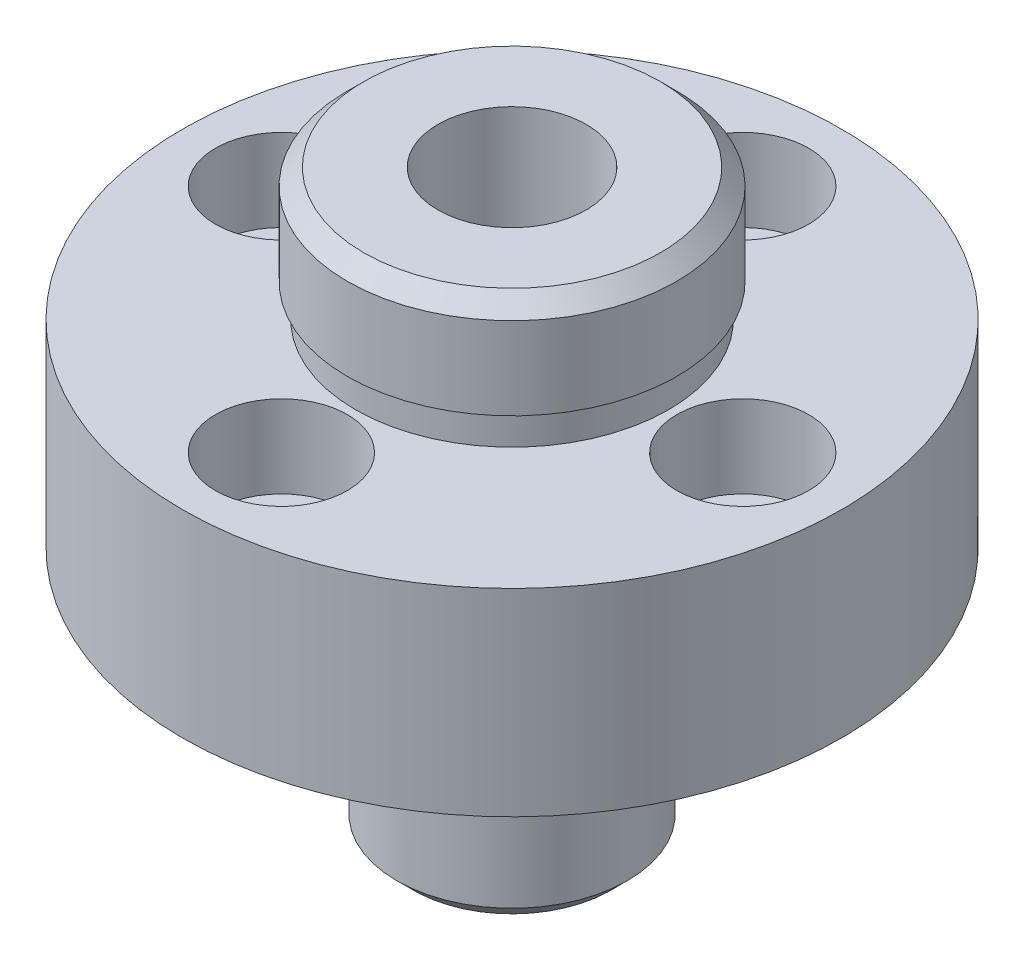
ISO-10303-21;
HEADER;
FILE_DESCRIPTION(('STEP AP214'),'2;1');
FILE_NAME('part.step','',(''),(''),'','','');
FILE_SCHEMA(('AUTOMOTIVE_DESIGN { 1 0 10303 214 1 1 1 1 }'));
ENDSEC;
DATA;
#1=APPLICATION_CONTEXT('core data for automotive mechanical design processes');
#2=APPLICATION_PROTOCOL_DEFINITION('international standard','automotive_design',2000,#1);
#3=PRODUCT_CONTEXT('',#1,'mechanical');
#4=PRODUCT('Part','Part','',(#3));
#5=PRODUCT_RELATED_PRODUCT_CATEGORY('part','',(#4));
#6=PRODUCT_DEFINITION_FORMATION('','',#4);
#7=PRODUCT_DEFINITION_CONTEXT('part definition',#1,'design');
#8=PRODUCT_DEFINITION('design','',#6,#7);
#9=PRODUCT_DEFINITION_SHAPE('','',#8);
#10=(LENGTH_UNIT() NAMED_UNIT(*) SI_UNIT(.MILLI.,.METRE.));
#11=(NAMED_UNIT(*) PLANE_ANGLE_UNIT() SI_UNIT($,.RADIAN.));
#12=(NAMED_UNIT(*) SI_UNIT($,.STERADIAN.) SOLID_ANGLE_UNIT());
#13=UNCERTAINTY_MEASURE_WITH_UNIT(LENGTH_MEASURE(1.E-05),#10,'distance_accuracy_value','');
#14=(GEOMETRIC_REPRESENTATION_CONTEXT(3) GLOBAL_UNCERTAINTY_ASSIGNED_CONTEXT((#13)) GLOBAL_UNIT_ASSIGNED_CONTEXT((#10,
#11,#12)) REPRESENTATION_CONTEXT('',''));
#15=CARTESIAN_POINT('',(0.,0.,0.));
#16=DIRECTION('',(0.,0.,1.));
#17=DIRECTION('',(1.,0.,0.));
#18=AXIS2_PLACEMENT_3D('',#15,#16,#17);
#19=CARTESIAN_POINT('',(0.,0.,0.));
#20=DIRECTION('',(0.,-1.,0.));
#21=DIRECTION('',(0.,0.,-1.));
#22=AXIS2_PLACEMENT_3D('',#19,#20,#21);
#23=PLANE('',#22);
#24=CARTESIAN_POINT('',(0.,0.,0.));
#25=DIRECTION('',(0.,1.,0.));
#26=DIRECTION('',(0.,0.,1.));
#27=AXIS2_PLACEMENT_3D('',#24,#25,#26);
#28=CIRCLE('',#27,4.49999999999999);
#29=CARTESIAN_POINT('',(0.,0.,4.49999999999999));
#30=VERTEX_POINT('',#29);
#31=EDGE_CURVE('E184',#30,#30,#28,.T.);
#32=ORIENTED_EDGE('',*,*,#31,.T.);
#33=EDGE_LOOP('',(#32));
#34=FACE_BOUND('',#33,.T.);
#35=CARTESIAN_POINT('',(0.,0.,0.));
#36=DIRECTION('',(0.,-1.,0.));
#37=DIRECTION('',(0.,0.,-1.));
#38=AXIS2_PLACEMENT_3D('',#35,#36,#37);
#39=CIRCLE('',#38,5.99999999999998);
#40=CARTESIAN_POINT('',(0.,0.,-5.99999999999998));
#41=VERTEX_POINT('',#40);
#42=EDGE_CURVE('E41',#41,#41,#39,.T.);
#43=ORIENTED_EDGE('',*,*,#42,.T.);
#44=EDGE_LOOP('',(#43));
#45=FACE_BOUND('',#44,.T.);
#46=ADVANCED_FACE('F28',(#34,#45),#23,.T.);
#47=CARTESIAN_POINT('',(0.,35.,0.));
#48=DIRECTION('',(0.,1.,0.));
#49=DIRECTION('',(0.,0.,1.));
#50=AXIS2_PLACEMENT_3D('',#47,#48,#49);
#51=CYLINDRICAL_SURFACE('',#50,7.);
#52=CARTESIAN_POINT('',(0.,1.,0.));
#53=DIRECTION('',(0.,-1.,0.));
#54=DIRECTION('',(0.,0.,-1.));
#55=AXIS2_PLACEMENT_3D('',#52,#53,#54);
#56=CIRCLE('',#55,7.);
#57=CARTESIAN_POINT('',(0.,1.,-7.));
#58=VERTEX_POINT('',#57);
#59=EDGE_CURVE('E107',#58,#58,#56,.F.);
#60=ORIENTED_EDGE('',*,*,#59,.T.);
#61=EDGE_LOOP('',(#60));
#62=FACE_BOUND('',#61,.T.);
#63=CARTESIAN_POINT('',(0.,13.,0.));
#64=DIRECTION('',(0.,1.,0.));
#65=DIRECTION('',(0.,0.,1.));
#66=AXIS2_PLACEMENT_3D('',#63,#64,#65);
#67=CIRCLE('',#66,7.);
#68=CARTESIAN_POINT('',(0.,13.,7.));
#69=VERTEX_POINT('',#68);
#70=EDGE_CURVE('E104',#69,#69,#67,.T.);
#71=ORIENTED_EDGE('',*,*,#70,.F.);
#72=EDGE_LOOP('',(#71));
#73=FACE_BOUND('',#72,.T.);
#74=ADVANCED_FACE('F119',(#62,#73),#51,.T.);
#75=CARTESIAN_POINT('',(-7.,13.,0.));
#76=DIRECTION('',(0.,1.,0.));
#77=DIRECTION('',(0.,0.,1.));
#78=AXIS2_PLACEMENT_3D('',#75,#76,#77);
#79=PLANE('',#78);
#80=ORIENTED_EDGE('',*,*,#70,.T.);
#81=EDGE_LOOP('',(#80));
#82=FACE_BOUND('',#81,.T.);
#83=CARTESIAN_POINT('',(0.,13.,0.));
#84=DIRECTION('',(0.,1.,0.));
#85=DIRECTION('',(0.,0.,1.));
#86=AXIS2_PLACEMENT_3D('',#83,#84,#85);
#87=CIRCLE('',#86,6.5);
#88=CARTESIAN_POINT('',(0.,13.,6.5));
#89=VERTEX_POINT('',#88);
#90=EDGE_CURVE('E101',#89,#89,#87,.T.);
#91=ORIENTED_EDGE('',*,*,#90,.F.);
#92=EDGE_LOOP('',(#91));
#93=FACE_BOUND('',#92,.T.);
#94=ADVANCED_FACE('F122',(#82,#93),#79,.T.);
#95=CARTESIAN_POINT('',(0.,35.,0.));
#96=DIRECTION('',(0.,1.,0.));
#97=DIRECTION('',(0.,0.,1.));
#98=AXIS2_PLACEMENT_3D('',#95,#96,#97);
#99=CYLINDRICAL_SURFACE('',#98,6.5);
#100=ORIENTED_EDGE('',*,*,#90,.T.);
#101=EDGE_LOOP('',(#100));
#102=FACE_BOUND('',#101,.T.);
#103=CARTESIAN_POINT('',(0.,15.,0.));
#104=DIRECTION('',(0.,1.,0.));
#105=DIRECTION('',(0.,0.,1.));
#106=AXIS2_PLACEMENT_3D('',#103,#104,#105);
#107=CIRCLE('',#106,6.5);
#108=CARTESIAN_POINT('',(0.,15.,6.5));
#109=VERTEX_POINT('',#108);
#110=EDGE_CURVE('E98',#109,#109,#107,.T.);
#111=ORIENTED_EDGE('',*,*,#110,.F.);
#112=EDGE_LOOP('',(#111));
#113=FACE_BOUND('',#112,.T.);
#114=ADVANCED_FACE('F128',(#102,#113),#99,.T.);
#115=CARTESIAN_POINT('',(-20.,15.,0.));
#116=DIRECTION('',(0.,-1.,0.));
#117=DIRECTION('',(0.,0.,-1.));
#118=AXIS2_PLACEMENT_3D('',#115,#116,#117);
#119=PLANE('',#118);
#120=CARTESIAN_POINT('',(-14.,15.,0.));
#121=DIRECTION('',(0.,-1.,0.));
#122=DIRECTION('',(0.,0.,-1.));
#123=AXIS2_PLACEMENT_3D('',#120,#121,#122);
#124=CIRCLE('',#123,2.25);
#125=CARTESIAN_POINT('',(-14.,15.,-2.25));
#126=VERTEX_POINT('',#125);
#127=EDGE_CURVE('E32',#126,#126,#124,.T.);
#128=ORIENTED_EDGE('',*,*,#127,.F.);
#129=EDGE_LOOP('',(#128));
#130=FACE_BOUND('',#129,.T.);
#131=CARTESIAN_POINT('',(0.,15.,-14.));
#132=DIRECTION('',(0.,-1.,0.));
#133=DIRECTION('',(0.,0.,-1.));
#134=AXIS2_PLACEMENT_3D('',#131,#132,#133);
#135=CIRCLE('',#134,2.25);
#136=CARTESIAN_POINT('',(0.,15.,-16.25));
#137=VERTEX_POINT('',#136);
#138=EDGE_CURVE('E54',#137,#137,#135,.T.);
#139=ORIENTED_EDGE('',*,*,#138,.F.);
#140=EDGE_LOOP('',(#139));
#141=FACE_BOUND('',#140,.T.);
#142=CARTESIAN_POINT('',(14.,15.,0.));
#143=DIRECTION('',(0.,-1.,0.));
#144=DIRECTION('',(0.,0.,-1.));
#145=AXIS2_PLACEMENT_3D('',#142,#143,#144);
#146=CIRCLE('',#145,2.25);
#147=CARTESIAN_POINT('',(14.,15.,-2.25));
#148=VERTEX_POINT('',#147);
#149=EDGE_CURVE('E50',#148,#148,#146,.T.);
#150=ORIENTED_EDGE('',*,*,#149,.F.);
#151=EDGE_LOOP('',(#150));
#152=FACE_BOUND('',#151,.T.);
#153=CARTESIAN_POINT('',(0.,15.,14.));
#154=DIRECTION('',(0.,-1.,0.));
#155=DIRECTION('',(0.,0.,-1.));
#156=AXIS2_PLACEMENT_3D('',#153,#154,#155);
#157=CIRCLE('',#156,2.25);
#158=CARTESIAN_POINT('',(0.,15.,11.75));
#159=VERTEX_POINT('',#158);
#160=EDGE_CURVE('E45',#159,#159,#157,.T.);
#161=ORIENTED_EDGE('',*,*,#160,.F.);
#162=EDGE_LOOP('',(#161));
#163=FACE_BOUND('',#162,.T.);
#164=ORIENTED_EDGE('',*,*,#110,.T.);
#165=EDGE_LOOP('',(#164));
#166=FACE_BOUND('',#165,.T.);
#167=CARTESIAN_POINT('',(0.,15.,0.));
#168=DIRECTION('',(0.,1.,0.));
#169=DIRECTION('',(0.,0.,1.));
#170=AXIS2_PLACEMENT_3D('',#167,#168,#169);
#171=CIRCLE('',#170,20.);
#172=CARTESIAN_POINT('',(0.,15.,20.));
#173=VERTEX_POINT('',#172);
#174=EDGE_CURVE('E95',#173,#173,#171,.T.);
#175=ORIENTED_EDGE('',*,*,#174,.F.);
#176=EDGE_LOOP('',(#175));
#177=FACE_BOUND('',#176,.T.);
#178=ADVANCED_FACE('F134',(#130,#141,#152,#163,#166,#177),#119,.T.);
#179=CARTESIAN_POINT('',(0.,35.,0.));
#180=DIRECTION('',(0.,1.,0.));
#181=DIRECTION('',(0.,0.,1.));
#182=AXIS2_PLACEMENT_3D('',#179,#180,#181);
#183=CYLINDRICAL_SURFACE('',#182,20.);
#184=ORIENTED_EDGE('',*,*,#174,.T.);
#185=EDGE_LOOP('',(#184));
#186=FACE_BOUND('',#185,.T.);
#187=CARTESIAN_POINT('',(0.,27.,0.));
#188=DIRECTION('',(0.,1.,0.));
#189=DIRECTION('',(0.,0.,1.));
#190=AXIS2_PLACEMENT_3D('',#187,#188,#189);
#191=CIRCLE('',#190,20.);
#192=CARTESIAN_POINT('',(0.,27.,20.));
#193=VERTEX_POINT('',#192);
#194=EDGE_CURVE('E92',#193,#193,#191,.T.);
#195=ORIENTED_EDGE('',*,*,#194,.F.);
#196=EDGE_LOOP('',(#195));
#197=FACE_BOUND('',#196,.T.);
#198=ADVANCED_FACE('F140',(#186,#197),#183,.T.);
#199=CARTESIAN_POINT('',(-20.,27.,0.));
#200=DIRECTION('',(0.,1.,0.));
#201=DIRECTION('',(0.,0.,1.));
#202=AXIS2_PLACEMENT_3D('',#199,#200,#201);
#203=PLANE('',#202);
#204=CARTESIAN_POINT('',(-14.,27.,0.));
#205=DIRECTION('',(0.,1.,0.));
#206=DIRECTION('',(0.,0.,1.));
#207=AXIS2_PLACEMENT_3D('',#204,#205,#206);
#208=CIRCLE('',#207,4.);
#209=CARTESIAN_POINT('',(-14.,27.,4.));
#210=VERTEX_POINT('',#209);
#211=EDGE_CURVE('E186',#210,#210,#208,.T.);
#212=ORIENTED_EDGE('',*,*,#211,.F.);
#213=EDGE_LOOP('',(#212));
#214=FACE_BOUND('',#213,.T.);
#215=CARTESIAN_POINT('',(0.,27.,-14.));
#216=DIRECTION('',(0.,1.,0.));
#217=DIRECTION('',(0.,0.,1.));
#218=AXIS2_PLACEMENT_3D('',#215,#216,#217);
#219=CIRCLE('',#218,4.);
#220=CARTESIAN_POINT('',(0.,27.,-10.));
#221=VERTEX_POINT('',#220);
#222=EDGE_CURVE('E69',#221,#221,#219,.T.);
#223=ORIENTED_EDGE('',*,*,#222,.F.);
#224=EDGE_LOOP('',(#223));
#225=FACE_BOUND('',#224,.T.);
#226=CARTESIAN_POINT('',(14.,27.,0.));
#227=DIRECTION('',(0.,1.,0.));
#228=DIRECTION('',(0.,0.,1.));
#229=AXIS2_PLACEMENT_3D('',#226,#227,#228);
#230=CIRCLE('',#229,4.);
#231=CARTESIAN_POINT('',(14.,27.,4.));
#232=VERTEX_POINT('',#231);
#233=EDGE_CURVE('E56',#232,#232,#230,.T.);
#234=ORIENTED_EDGE('',*,*,#233,.F.);
#235=EDGE_LOOP('',(#234));
#236=FACE_BOUND('',#235,.T.);
#237=CARTESIAN_POINT('',(0.,27.,14.));
#238=DIRECTION('',(0.,1.,0.));
#239=DIRECTION('',(0.,0.,1.));
#240=AXIS2_PLACEMENT_3D('',#237,#238,#239);
#241=CIRCLE('',#240,4.);
#242=CARTESIAN_POINT('',(0.,27.,18.));
#243=VERTEX_POINT('',#242);
#244=EDGE_CURVE('E52',#243,#243,#241,.T.);
#245=ORIENTED_EDGE('',*,*,#244,.F.);
#246=EDGE_LOOP('',(#245));
#247=FACE_BOUND('',#246,.T.);
#248=ORIENTED_EDGE('',*,*,#194,.T.);
#249=EDGE_LOOP('',(#248));
#250=FACE_BOUND('',#249,.T.);
#251=CARTESIAN_POINT('',(0.,27.,0.));
#252=DIRECTION('',(0.,1.,0.));
#253=DIRECTION('',(0.,0.,1.));
#254=AXIS2_PLACEMENT_3D('',#251,#252,#253);
#255=CIRCLE('',#254,9.5);
#256=CARTESIAN_POINT('',(0.,27.,9.5));
#257=VERTEX_POINT('',#256);
#258=EDGE_CURVE('E89',#257,#257,#255,.T.);
#259=ORIENTED_EDGE('',*,*,#258,.F.);
#260=EDGE_LOOP('',(#259));
#261=FACE_BOUND('',#260,.T.);
#262=ADVANCED_FACE('F147',(#214,#225,#236,#247,#250,#261),#203,.T.);
#263=CARTESIAN_POINT('',(0.,35.,0.));
#264=DIRECTION('',(0.,1.,0.));
#265=DIRECTION('',(0.,0.,1.));
#266=AXIS2_PLACEMENT_3D('',#263,#264,#265);
#267=CYLINDRICAL_SURFACE('',#266,9.5);
#268=ORIENTED_EDGE('',*,*,#258,.T.);
#269=EDGE_LOOP('',(#268));
#270=FACE_BOUND('',#269,.T.);
#271=CARTESIAN_POINT('',(0.,29.,0.));
#272=DIRECTION('',(0.,1.,0.));
#273=DIRECTION('',(0.,0.,1.));
#274=AXIS2_PLACEMENT_3D('',#271,#272,#273);
#275=CIRCLE('',#274,9.5);
#276=CARTESIAN_POINT('',(0.,29.,9.5));
#277=VERTEX_POINT('',#276);
#278=EDGE_CURVE('E86',#277,#277,#275,.T.);
#279=ORIENTED_EDGE('',*,*,#278,.F.);
#280=EDGE_LOOP('',(#279));
#281=FACE_BOUND('',#280,.T.);
#282=ADVANCED_FACE('F153',(#270,#281),#267,.T.);
#283=CARTESIAN_POINT('',(-9.5,29.,0.));
#284=DIRECTION('',(0.,-1.,0.));
#285=DIRECTION('',(0.,0.,-1.));
#286=AXIS2_PLACEMENT_3D('',#283,#284,#285);
#287=PLANE('',#286);
#288=ORIENTED_EDGE('',*,*,#278,.T.);
#289=EDGE_LOOP('',(#288));
#290=FACE_BOUND('',#289,.T.);
#291=CARTESIAN_POINT('',(0.,29.,0.));
#292=DIRECTION('',(0.,1.,0.));
#293=DIRECTION('',(0.,0.,1.));
#294=AXIS2_PLACEMENT_3D('',#291,#292,#293);
#295=CIRCLE('',#294,10.);
#296=CARTESIAN_POINT('',(0.,29.,10.));
#297=VERTEX_POINT('',#296);
#298=EDGE_CURVE('E48',#297,#297,#295,.T.);
#299=ORIENTED_EDGE('',*,*,#298,.F.);
#300=EDGE_LOOP('',(#299));
#301=FACE_BOUND('',#300,.T.);
#302=ADVANCED_FACE('F160',(#290,#301),#287,.T.);
#303=CARTESIAN_POINT('',(0.,35.,0.));
#304=DIRECTION('',(0.,1.,0.));
#305=DIRECTION('',(0.,0.,1.));
#306=AXIS2_PLACEMENT_3D('',#303,#304,#305);
#307=CYLINDRICAL_SURFACE('',#306,10.);
#308=CARTESIAN_POINT('',(0.,34.,0.));
#309=DIRECTION('',(0.,1.,0.));
#310=DIRECTION('',(0.,0.,1.));
#311=AXIS2_PLACEMENT_3D('',#308,#309,#310);
#312=CIRCLE('',#311,10.);
#313=CARTESIAN_POINT('',(0.,34.,10.));
#314=VERTEX_POINT('',#313);
#315=EDGE_CURVE('E10',#314,#314,#312,.F.);
#316=ORIENTED_EDGE('',*,*,#315,.T.);
#317=EDGE_LOOP('',(#316));
#318=FACE_BOUND('',#317,.T.);
#319=ORIENTED_EDGE('',*,*,#298,.T.);
#320=EDGE_LOOP('',(#319));
#321=FACE_BOUND('',#320,.T.);
#322=ADVANCED_FACE('F166',(#318,#321),#307,.T.);
#323=CARTESIAN_POINT('',(-10.,35.,0.));
#324=DIRECTION('',(0.,1.,0.));
#325=DIRECTION('',(0.,0.,1.));
#326=AXIS2_PLACEMENT_3D('',#323,#324,#325);
#327=PLANE('',#326);
#328=CARTESIAN_POINT('',(0.,35.,0.));
#329=DIRECTION('',(0.,1.,0.));
#330=DIRECTION('',(0.,0.,1.));
#331=AXIS2_PLACEMENT_3D('',#328,#329,#330);
#332=CIRCLE('',#331,4.49999999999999);
#333=CARTESIAN_POINT('',(0.,35.,4.49999999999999));
#334=VERTEX_POINT('',#333);
#335=EDGE_CURVE('E187',#334,#334,#332,.T.);
#336=ORIENTED_EDGE('',*,*,#335,.F.);
#337=EDGE_LOOP('',(#336));
#338=FACE_BOUND('',#337,.T.);
#339=CARTESIAN_POINT('',(0.,35.,0.));
#340=DIRECTION('',(0.,1.,0.));
#341=DIRECTION('',(0.,0.,1.));
#342=AXIS2_PLACEMENT_3D('',#339,#340,#341);
#343=CIRCLE('',#342,8.99999999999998);
#344=CARTESIAN_POINT('',(0.,35.,8.99999999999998));
#345=VERTEX_POINT('',#344);
#346=EDGE_CURVE('E36',#345,#345,#343,.T.);
#347=ORIENTED_EDGE('',*,*,#346,.T.);
#348=EDGE_LOOP('',(#347));
#349=FACE_BOUND('',#348,.T.);
#350=ADVANCED_FACE('F116',(#338,#349),#327,.T.);
#351=CARTESIAN_POINT('',(0.,1.,0.));
#352=DIRECTION('',(0.,1.,0.));
#353=DIRECTION('',(0.,0.,1.));
#354=AXIS2_PLACEMENT_3D('',#351,#352,#353);
#355=CONICAL_SURFACE('',#354,7.,0.785398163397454);
#356=ORIENTED_EDGE('',*,*,#42,.F.);
#357=EDGE_LOOP('',(#356));
#358=FACE_BOUND('',#357,.T.);
#359=ORIENTED_EDGE('',*,*,#59,.F.);
#360=EDGE_LOOP('',(#359));
#361=FACE_BOUND('',#360,.T.);
#362=ADVANCED_FACE('F113',(#358,#361),#355,.T.);
#363=CARTESIAN_POINT('',(0.,35.,0.));
#364=DIRECTION('',(0.,-1.,0.));
#365=DIRECTION('',(0.,0.,-1.));
#366=AXIS2_PLACEMENT_3D('',#363,#364,#365);
#367=CONICAL_SURFACE('',#366,8.99999999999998,0.785398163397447);
#368=ORIENTED_EDGE('',*,*,#315,.F.);
#369=EDGE_LOOP('',(#368));
#370=FACE_BOUND('',#369,.T.);
#371=ORIENTED_EDGE('',*,*,#346,.F.);
#372=EDGE_LOOP('',(#371));
#373=FACE_BOUND('',#372,.T.);
#374=ADVANCED_FACE('F30',(#370,#373),#367,.T.);
#375=CARTESIAN_POINT('',(0.,27.,14.));
#376=DIRECTION('',(0.,1.,0.));
#377=DIRECTION('',(0.,0.,1.));
#378=AXIS2_PLACEMENT_3D('',#375,#376,#377);
#379=CYLINDRICAL_SURFACE('',#378,2.25);
#380=ORIENTED_EDGE('',*,*,#160,.T.);
#381=EDGE_LOOP('',(#380));
#382=FACE_BOUND('',#381,.T.);
#383=CARTESIAN_POINT('',(0.,22.,14.));
#384=DIRECTION('',(0.,1.,0.));
#385=DIRECTION('',(0.,0.,1.));
#386=AXIS2_PLACEMENT_3D('',#383,#384,#385);
#387=CIRCLE('',#386,2.25);
#388=CARTESIAN_POINT('',(0.,22.,16.25));
#389=VERTEX_POINT('',#388);
#390=EDGE_CURVE('E49',#389,#389,#387,.T.);
#391=ORIENTED_EDGE('',*,*,#390,.T.);
#392=EDGE_LOOP('',(#391));
#393=FACE_BOUND('',#392,.T.);
#394=ADVANCED_FACE('F213',(#382,#393),#379,.F.);
#395=CARTESIAN_POINT('',(2.25,22.,14.));
#396=DIRECTION('',(0.,-1.,0.));
#397=DIRECTION('',(0.,0.,-1.));
#398=AXIS2_PLACEMENT_3D('',#395,#396,#397);
#399=PLANE('',#398);
#400=ORIENTED_EDGE('',*,*,#390,.F.);
#401=EDGE_LOOP('',(#400));
#402=FACE_BOUND('',#401,.T.);
#403=CARTESIAN_POINT('',(0.,22.,14.));
#404=DIRECTION('',(0.,1.,0.));
#405=DIRECTION('',(0.,0.,1.));
#406=AXIS2_PLACEMENT_3D('',#403,#404,#405);
#407=CIRCLE('',#406,4.);
#408=CARTESIAN_POINT('',(0.,22.,18.));
#409=VERTEX_POINT('',#408);
#410=EDGE_CURVE('E79',#409,#409,#407,.T.);
#411=ORIENTED_EDGE('',*,*,#410,.T.);
#412=EDGE_LOOP('',(#411));
#413=FACE_BOUND('',#412,.T.);
#414=ADVANCED_FACE('F216',(#402,#413),#399,.F.);
#415=CARTESIAN_POINT('',(0.,27.,14.));
#416=DIRECTION('',(0.,1.,0.));
#417=DIRECTION('',(0.,0.,1.));
#418=AXIS2_PLACEMENT_3D('',#415,#416,#417);
#419=CYLINDRICAL_SURFACE('',#418,4.);
#420=ORIENTED_EDGE('',*,*,#410,.F.);
#421=EDGE_LOOP('',(#420));
#422=FACE_BOUND('',#421,.T.);
#423=ORIENTED_EDGE('',*,*,#244,.T.);
#424=EDGE_LOOP('',(#423));
#425=FACE_BOUND('',#424,.T.);
#426=ADVANCED_FACE('F222',(#422,#425),#419,.F.);
#427=CARTESIAN_POINT('',(14.,27.,0.));
#428=DIRECTION('',(0.,1.,0.));
#429=DIRECTION('',(0.,0.,1.));
#430=AXIS2_PLACEMENT_3D('',#427,#428,#429);
#431=CYLINDRICAL_SURFACE('',#430,2.25);
#432=ORIENTED_EDGE('',*,*,#149,.T.);
#433=EDGE_LOOP('',(#432));
#434=FACE_BOUND('',#433,.T.);
#435=CARTESIAN_POINT('',(14.,22.,0.));
#436=DIRECTION('',(0.,1.,0.));
#437=DIRECTION('',(0.,0.,1.));
#438=AXIS2_PLACEMENT_3D('',#435,#436,#437);
#439=CIRCLE('',#438,2.25);
#440=CARTESIAN_POINT('',(14.,22.,2.25));
#441=VERTEX_POINT('',#440);
#442=EDGE_CURVE('E53',#441,#441,#439,.T.);
#443=ORIENTED_EDGE('',*,*,#442,.T.);
#444=EDGE_LOOP('',(#443));
#445=FACE_BOUND('',#444,.T.);
#446=ADVANCED_FACE('F228',(#434,#445),#431,.F.);
#447=CARTESIAN_POINT('',(16.25,22.,0.));
#448=DIRECTION('',(0.,-1.,0.));
#449=DIRECTION('',(0.,0.,-1.));
#450=AXIS2_PLACEMENT_3D('',#447,#448,#449);
#451=PLANE('',#450);
#452=ORIENTED_EDGE('',*,*,#442,.F.);
#453=EDGE_LOOP('',(#452));
#454=FACE_BOUND('',#453,.T.);
#455=CARTESIAN_POINT('',(14.,22.,0.));
#456=DIRECTION('',(0.,1.,0.));
#457=DIRECTION('',(0.,0.,1.));
#458=AXIS2_PLACEMENT_3D('',#455,#456,#457);
#459=CIRCLE('',#458,4.);
#460=CARTESIAN_POINT('',(14.,22.,4.));
#461=VERTEX_POINT('',#460);
#462=EDGE_CURVE('E61',#461,#461,#459,.T.);
#463=ORIENTED_EDGE('',*,*,#462,.T.);
#464=EDGE_LOOP('',(#463));
#465=FACE_BOUND('',#464,.T.);
#466=ADVANCED_FACE('F235',(#454,#465),#451,.F.);
#467=CARTESIAN_POINT('',(14.,27.,0.));
#468=DIRECTION('',(0.,1.,0.));
#469=DIRECTION('',(0.,0.,1.));
#470=AXIS2_PLACEMENT_3D('',#467,#468,#469);
#471=CYLINDRICAL_SURFACE('',#470,4.);
#472=ORIENTED_EDGE('',*,*,#462,.F.);
#473=EDGE_LOOP('',(#472));
#474=FACE_BOUND('',#473,.T.);
#475=ORIENTED_EDGE('',*,*,#233,.T.);
#476=EDGE_LOOP('',(#475));
#477=FACE_BOUND('',#476,.T.);
#478=ADVANCED_FACE('F241',(#474,#477),#471,.F.);
#479=CARTESIAN_POINT('',(0.,27.,-14.));
#480=DIRECTION('',(0.,1.,0.));
#481=DIRECTION('',(0.,0.,1.));
#482=AXIS2_PLACEMENT_3D('',#479,#480,#481);
#483=CYLINDRICAL_SURFACE('',#482,2.25);
#484=ORIENTED_EDGE('',*,*,#138,.T.);
#485=EDGE_LOOP('',(#484));
#486=FACE_BOUND('',#485,.T.);
#487=CARTESIAN_POINT('',(0.,22.,-14.));
#488=DIRECTION('',(0.,1.,0.));
#489=DIRECTION('',(0.,0.,1.));
#490=AXIS2_PLACEMENT_3D('',#487,#488,#489);
#491=CIRCLE('',#490,2.25);
#492=CARTESIAN_POINT('',(0.,22.,-11.75));
#493=VERTEX_POINT('',#492);
#494=EDGE_CURVE('E57',#493,#493,#491,.T.);
#495=ORIENTED_EDGE('',*,*,#494,.T.);
#496=EDGE_LOOP('',(#495));
#497=FACE_BOUND('',#496,.T.);
#498=ADVANCED_FACE('F245',(#486,#497),#483,.F.);
#499=CARTESIAN_POINT('',(2.25,22.,-14.));
#500=DIRECTION('',(0.,-1.,0.));
#501=DIRECTION('',(0.,0.,-1.));
#502=AXIS2_PLACEMENT_3D('',#499,#500,#501);
#503=PLANE('',#502);
#504=ORIENTED_EDGE('',*,*,#494,.F.);
#505=EDGE_LOOP('',(#504));
#506=FACE_BOUND('',#505,.T.);
#507=CARTESIAN_POINT('',(0.,22.,-14.));
#508=DIRECTION('',(0.,1.,0.));
#509=DIRECTION('',(0.,0.,1.));
#510=AXIS2_PLACEMENT_3D('',#507,#508,#509);
#511=CIRCLE('',#510,4.);
#512=CARTESIAN_POINT('',(0.,22.,-10.));
#513=VERTEX_POINT('',#512);
#514=EDGE_CURVE('E64',#513,#513,#511,.T.);
#515=ORIENTED_EDGE('',*,*,#514,.T.);
#516=EDGE_LOOP('',(#515));
#517=FACE_BOUND('',#516,.T.);
#518=ADVANCED_FACE('F249',(#506,#517),#503,.F.);
#519=CARTESIAN_POINT('',(0.,27.,-14.));
#520=DIRECTION('',(0.,1.,0.));
#521=DIRECTION('',(0.,0.,1.));
#522=AXIS2_PLACEMENT_3D('',#519,#520,#521);
#523=CYLINDRICAL_SURFACE('',#522,4.);
#524=ORIENTED_EDGE('',*,*,#514,.F.);
#525=EDGE_LOOP('',(#524));
#526=FACE_BOUND('',#525,.T.);
#527=ORIENTED_EDGE('',*,*,#222,.T.);
#528=EDGE_LOOP('',(#527));
#529=FACE_BOUND('',#528,.T.);
#530=ADVANCED_FACE('F252',(#526,#529),#523,.F.);
#531=CARTESIAN_POINT('',(-14.,27.,0.));
#532=DIRECTION('',(0.,1.,0.));
#533=DIRECTION('',(0.,0.,1.));
#534=AXIS2_PLACEMENT_3D('',#531,#532,#533);
#535=CYLINDRICAL_SURFACE('',#534,2.25);
#536=ORIENTED_EDGE('',*,*,#127,.T.);
#537=EDGE_LOOP('',(#536));
#538=FACE_BOUND('',#537,.T.);
#539=CARTESIAN_POINT('',(-14.,22.,0.));
#540=DIRECTION('',(0.,1.,0.));
#541=DIRECTION('',(0.,0.,1.));
#542=AXIS2_PLACEMENT_3D('',#539,#540,#541);
#543=CIRCLE('',#542,2.25);
#544=CARTESIAN_POINT('',(-14.,22.,2.25));
#545=VERTEX_POINT('',#544);
#546=EDGE_CURVE('E197',#545,#545,#543,.T.);
#547=ORIENTED_EDGE('',*,*,#546,.T.);
#548=EDGE_LOOP('',(#547));
#549=FACE_BOUND('',#548,.T.);
#550=ADVANCED_FACE('F205',(#538,#549),#535,.F.);
#551=CARTESIAN_POINT('',(-11.75,22.,0.));
#552=DIRECTION('',(0.,-1.,0.));
#553=DIRECTION('',(0.,0.,-1.));
#554=AXIS2_PLACEMENT_3D('',#551,#552,#553);
#555=PLANE('',#554);
#556=ORIENTED_EDGE('',*,*,#546,.F.);
#557=EDGE_LOOP('',(#556));
#558=FACE_BOUND('',#557,.T.);
#559=CARTESIAN_POINT('',(-14.,22.,0.));
#560=DIRECTION('',(0.,1.,0.));
#561=DIRECTION('',(0.,0.,1.));
#562=AXIS2_PLACEMENT_3D('',#559,#560,#561);
#563=CIRCLE('',#562,4.);
#564=CARTESIAN_POINT('',(-14.,22.,4.));
#565=VERTEX_POINT('',#564);
#566=EDGE_CURVE('E190',#565,#565,#563,.T.);
#567=ORIENTED_EDGE('',*,*,#566,.T.);
#568=EDGE_LOOP('',(#567));
#569=FACE_BOUND('',#568,.T.);
#570=ADVANCED_FACE('F259',(#558,#569),#555,.F.);
#571=CARTESIAN_POINT('',(-14.,27.,0.));
#572=DIRECTION('',(0.,1.,0.));
#573=DIRECTION('',(0.,0.,1.));
#574=AXIS2_PLACEMENT_3D('',#571,#572,#573);
#575=CYLINDRICAL_SURFACE('',#574,4.);
#576=ORIENTED_EDGE('',*,*,#566,.F.);
#577=EDGE_LOOP('',(#576));
#578=FACE_BOUND('',#577,.T.);
#579=ORIENTED_EDGE('',*,*,#211,.T.);
#580=EDGE_LOOP('',(#579));
#581=FACE_BOUND('',#580,.T.);
#582=ADVANCED_FACE('F262',(#578,#581),#575,.F.);
#583=CARTESIAN_POINT('',(0.,35.,0.));
#584=DIRECTION('',(0.,1.,0.));
#585=DIRECTION('',(0.,0.,1.));
#586=AXIS2_PLACEMENT_3D('',#583,#584,#585);
#587=CYLINDRICAL_SURFACE('',#586,4.49999999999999);
#588=ORIENTED_EDGE('',*,*,#31,.F.);
#589=EDGE_LOOP('',(#588));
#590=FACE_BOUND('',#589,.T.);
#591=ORIENTED_EDGE('',*,*,#335,.T.);
#592=EDGE_LOOP('',(#591));
#593=FACE_BOUND('',#592,.T.);
#594=ADVANCED_FACE('F266',(#590,#593),#587,.F.);
#595=CLOSED_SHELL('',(#46,#74,#94,#114,#178,#198,#262,#282,#302,#322,#350,#362,#374,#394,#414,
#426,#446,#466,#478,#498,#518,#530,#550,#570,#582,#594));
#596=MANIFOLD_SOLID_BREP('B2',#595);
#597=ADVANCED_BREP_SHAPE_REPRESENTATION('',(#18,#596),#14);
#598=SHAPE_DEFINITION_REPRESENTATION(#9,#597);
ENDSEC;
END-ISO-10303-21;
